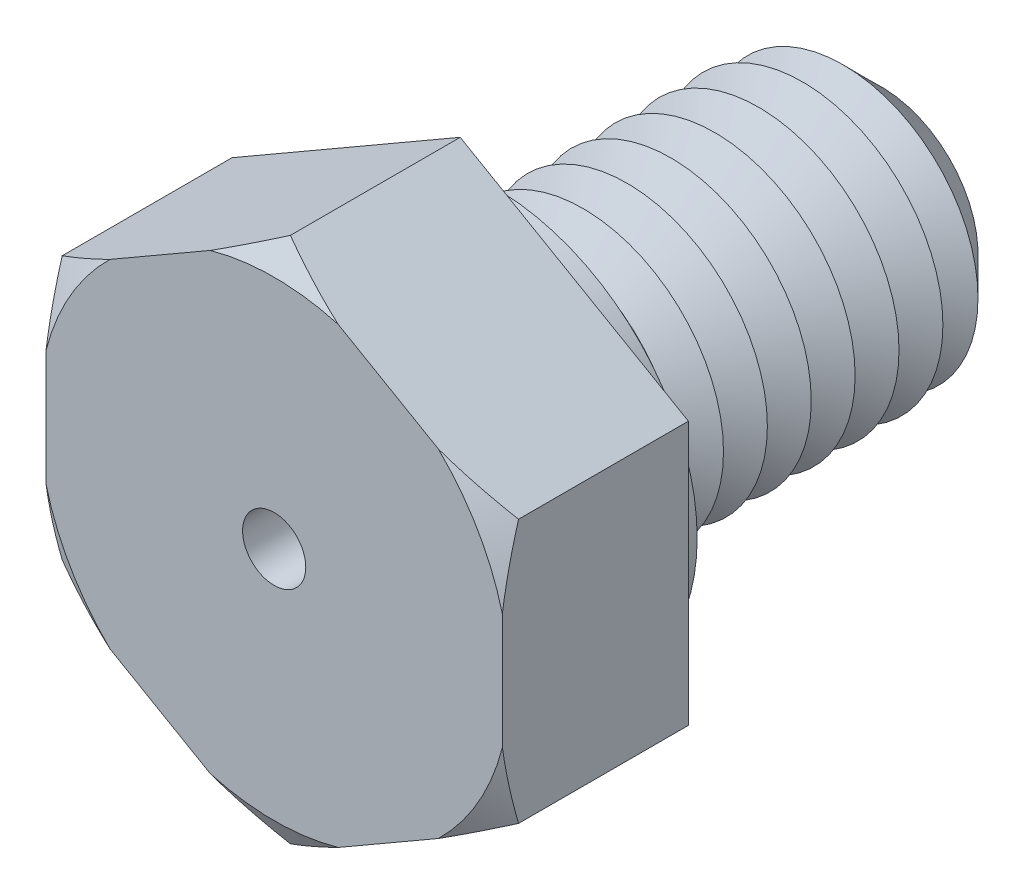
from build123d import *

# Parameters (mm, degrees)
BOSS_EXTRUDE1_DEPTH = 5.3
SKETCH3_R           = 4
BOSS_EXTRUDE2_DEPTH = 12
SKETCH4_R           = 5.75
BOSS_EXTRUDE3_DEPTH = 1
CHAMFER1_SIZE       = 1.25
LPATTERN1_COUNT     = 8
LPATTERN1_PITCH     = 1.25
SKETCH8_R           = 0.9
CUT_EXTRUDE1_DEPTH  = 17.3


with BuildPart() as part:
    # Sketch2 → Boss-Extrude1 (new body)
    with BuildSketch(Plane.XY):
        Polygon((0, 7.505553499), (-6.5, 3.75277675), (-6.5, -3.75277675), (0, -7.505553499), (6.5, -3.75277675), (6.5, 3.75277675), align=None)
    extrude(amount=BOSS_EXTRUDE1_DEPTH)

    # Sketch3 → Boss-Extrude2 (add)
    with BuildSketch(Plane(origin=(0, 0, 0), x_dir=(-1, 0, 0), z_dir=(0, 0, -1))):
        Circle(SKETCH3_R)
    extrude(amount=BOSS_EXTRUDE2_DEPTH)

    # Sketch4 → Boss-Extrude3 (add)
    with BuildSketch(Plane(origin=(0, 0, 0), x_dir=(-1, 0, 0), z_dir=(0, 0, -1))):
        with Locations(Location((0, 0, 0), (0, 0, 180))):
            Circle(SKETCH4_R)
    extrude(amount=BOSS_EXTRUDE3_DEPTH)

    # Chamfer1
    chamfer1_edges = [part.edges().sort_by_distance(p)[0] for p in [
        (4, 0, -12),
    ]]
    chamfer(chamfer1_edges, length=CHAMFER1_SIZE)

    # Sketch6 → Cut-Revolve1 (revolve, cut)
    with BuildSketch(Plane(origin=(0, 0, 0), x_dir=(0, 0, -1), z_dir=(1, 0, 0)), mode=Mode.PRIVATE) as cut_revolve1_sk:
        Polygon((1, 4), (1.625, 2.917468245), (2.25, 4), align=None)
    cut_revolve1 = revolve(cut_revolve1_sk.sketch.rotate(Axis((0, 0, 3.211670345), (0, 0, -1)), 90), axis=Axis((0, 0, 3.211670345), (0, 0, -1)), mode=Mode.SUBTRACT)

    # LPattern1: Cut-Revolve1 ×8
    with Locations(*[(0, 0, -i * LPATTERN1_PITCH) for i in range(1, LPATTERN1_COUNT)]):
        add(cut_revolve1, mode=Mode.SUBTRACT)

    # Sketch7 → Cut-Revolve2 (revolve, cut)
    with BuildSketch(Plane(origin=(0, 0, 0), x_dir=(0, 0, -1), z_dir=(1, 0, 0)), mode=Mode.PRIVATE) as cut_revolve2_sk:
        Polygon((-5.3, 7.505553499), (-5.3, 6.705553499), (-4.838119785, 7.505553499), align=None)
    revolve(cut_revolve2_sk.sketch.rotate(Axis((0, 0, 3.211670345), (0, 0, -1)), 270), axis=Axis((0, 0, 3.211670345), (0, 0, -1)), mode=Mode.SUBTRACT)

    # Sketch8 → Cut-Extrude1 (cut)
    with BuildSketch(Plane.XY.offset(5.3)):
        Circle(SKETCH8_R)
    extrude(amount=-CUT_EXTRUDE1_DEPTH, mode=Mode.SUBTRACT)


solid = part.part
